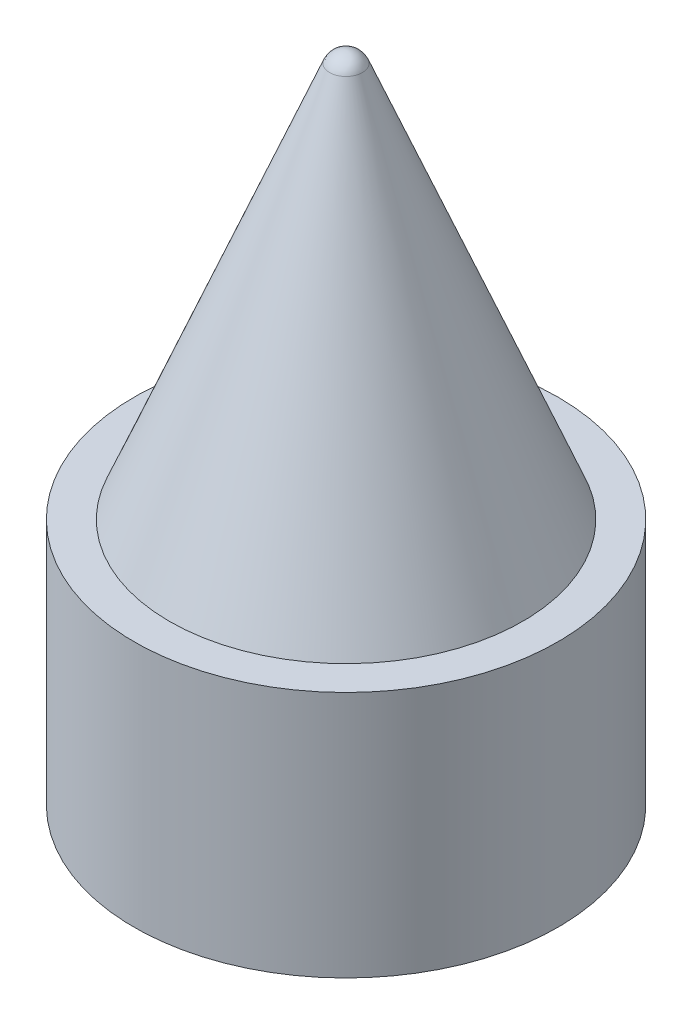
ISO-10303-21;
HEADER;
FILE_DESCRIPTION(('STEP AP214'),'2;1');
FILE_NAME('part.step','',(''),(''),'','','');
FILE_SCHEMA(('AUTOMOTIVE_DESIGN { 1 0 10303 214 1 1 1 1 }'));
ENDSEC;
DATA;
#1=APPLICATION_CONTEXT('core data for automotive mechanical design processes');
#2=APPLICATION_PROTOCOL_DEFINITION('international standard','automotive_design',2000,#1);
#3=PRODUCT_CONTEXT('',#1,'mechanical');
#4=PRODUCT('Part','Part','',(#3));
#5=PRODUCT_RELATED_PRODUCT_CATEGORY('part','',(#4));
#6=PRODUCT_DEFINITION_FORMATION('','',#4);
#7=PRODUCT_DEFINITION_CONTEXT('part definition',#1,'design');
#8=PRODUCT_DEFINITION('design','',#6,#7);
#9=PRODUCT_DEFINITION_SHAPE('','',#8);
#10=(LENGTH_UNIT() NAMED_UNIT(*) SI_UNIT(.MILLI.,.METRE.));
#11=(NAMED_UNIT(*) PLANE_ANGLE_UNIT() SI_UNIT($,.RADIAN.));
#12=(NAMED_UNIT(*) SI_UNIT($,.STERADIAN.) SOLID_ANGLE_UNIT());
#13=UNCERTAINTY_MEASURE_WITH_UNIT(LENGTH_MEASURE(1.E-05),#10,'distance_accuracy_value','');
#14=(GEOMETRIC_REPRESENTATION_CONTEXT(3) GLOBAL_UNCERTAINTY_ASSIGNED_CONTEXT((#13)) GLOBAL_UNIT_ASSIGNED_CONTEXT((#10,
#11,#12)) REPRESENTATION_CONTEXT('',''));
#15=CARTESIAN_POINT('',(0.,0.,0.));
#16=DIRECTION('',(0.,0.,1.));
#17=DIRECTION('',(1.,0.,0.));
#18=AXIS2_PLACEMENT_3D('',#15,#16,#17);
#19=CARTESIAN_POINT('',(0.,-5.,0.));
#20=DIRECTION('',(0.,-1.,0.));
#21=DIRECTION('',(0.,0.,-1.));
#22=AXIS2_PLACEMENT_3D('',#19,#20,#21);
#23=PLANE('',#22);
#24=CARTESIAN_POINT('',(0.,-5.,0.));
#25=DIRECTION('',(0.,-1.,0.));
#26=DIRECTION('',(0.,0.,-1.));
#27=AXIS2_PLACEMENT_3D('',#24,#25,#26);
#28=CIRCLE('',#27,6.);
#29=CARTESIAN_POINT('',(0.,-5.,-6.));
#30=VERTEX_POINT('',#29);
#31=EDGE_CURVE('E76',#30,#30,#28,.T.);
#32=ORIENTED_EDGE('',*,*,#31,.T.);
#33=EDGE_LOOP('',(#32));
#34=FACE_BOUND('',#33,.T.);
#35=CARTESIAN_POINT('',(0.,-5.,0.000228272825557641));
#36=DIRECTION('',(0.,-1.,0.));
#37=DIRECTION('',(0.,0.,-1.));
#38=AXIS2_PLACEMENT_3D('',#35,#36,#37);
#39=CIRCLE('',#38,4.99977174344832);
#40=CARTESIAN_POINT('',(0.,-5.,-4.99954347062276));
#41=VERTEX_POINT('',#40);
#42=EDGE_CURVE('E68',#41,#41,#39,.T.);
#43=ORIENTED_EDGE('',*,*,#42,.F.);
#44=EDGE_LOOP('',(#43));
#45=FACE_BOUND('',#44,.T.);
#46=ADVANCED_FACE('F41',(#34,#45),#23,.T.);
#47=CARTESIAN_POINT('',(0.,2.,0.));
#48=DIRECTION('',(0.,-1.,0.));
#49=DIRECTION('',(0.,0.,-1.));
#50=AXIS2_PLACEMENT_3D('',#47,#48,#49);
#51=CYLINDRICAL_SURFACE('',#50,6.);
#52=CARTESIAN_POINT('',(0.,2.,0.));
#53=DIRECTION('',(0.,-1.,0.));
#54=DIRECTION('',(0.,0.,-1.));
#55=AXIS2_PLACEMENT_3D('',#52,#53,#54);
#56=CIRCLE('',#55,6.);
#57=CARTESIAN_POINT('',(0.,2.,-6.));
#58=VERTEX_POINT('',#57);
#59=EDGE_CURVE('E50',#58,#58,#56,.T.);
#60=ORIENTED_EDGE('',*,*,#59,.T.);
#61=EDGE_LOOP('',(#60));
#62=FACE_BOUND('',#61,.T.);
#63=ORIENTED_EDGE('',*,*,#31,.F.);
#64=EDGE_LOOP('',(#63));
#65=FACE_BOUND('',#64,.T.);
#66=ADVANCED_FACE('F43',(#62,#65),#51,.T.);
#67=CARTESIAN_POINT('',(6.,2.,0.));
#68=DIRECTION('',(0.,1.,0.));
#69=DIRECTION('',(0.,0.,1.));
#70=AXIS2_PLACEMENT_3D('',#67,#68,#69);
#71=PLANE('',#70);
#72=CARTESIAN_POINT('',(0.,2.,-3.11540606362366E-06));
#73=DIRECTION('',(0.,1.,0.));
#74=DIRECTION('',(0.,0.,-1.));
#75=AXIS2_PLACEMENT_3D('',#72,#73,#74);
#76=ELLIPSE('',#75,5.00000311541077,5.00000307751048);
#77=CARTESIAN_POINT('',(0.,2.,-5.00000623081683));
#78=VERTEX_POINT('',#77);
#79=EDGE_CURVE('E11',#78,#78,#76,.T.);
#80=ORIENTED_EDGE('',*,*,#79,.F.);
#81=EDGE_LOOP('',(#80));
#82=FACE_BOUND('',#81,.T.);
#83=ORIENTED_EDGE('',*,*,#59,.F.);
#84=EDGE_LOOP('',(#83));
#85=FACE_BOUND('',#84,.T.);
#86=ADVANCED_FACE('F95',(#82,#85),#71,.T.);
#87=CARTESIAN_POINT('',(0.,2.00057049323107,0.000228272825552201));
#88=DIRECTION('',(0.,-0.999999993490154,-0.000114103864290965));
#89=DIRECTION('',(0.,0.000114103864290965,-0.999999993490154));
#90=AXIS2_PLACEMENT_3D('',#87,#88,#89);
#91=CONICAL_SURFACE('',#90,4.99977175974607,0.385204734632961);
#92=ORIENTED_EDGE('',*,*,#79,.T.);
#93=EDGE_LOOP('',(#92));
#94=FACE_BOUND('',#93,.T.);
#95=CARTESIAN_POINT('',(0.,13.1878744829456,0.00150478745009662));
#96=DIRECTION('',(0.,-0.999999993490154,-0.000114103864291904));
#97=DIRECTION('',(0.,-0.000114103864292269,0.999999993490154));
#98=AXIS2_PLACEMENT_3D('',#95,#96,#97);
#99=CIRCLE('',#98,0.463763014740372);
#100=CARTESIAN_POINT('',(0.,13.1878215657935,0.465267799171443));
#101=VERTEX_POINT('',#100);
#102=EDGE_CURVE('E67',#101,#101,#99,.T.);
#103=ORIENTED_EDGE('',*,*,#102,.T.);
#104=EDGE_LOOP('',(#103));
#105=FACE_BOUND('',#104,.T.);
#106=ADVANCED_FACE('F61',(#94,#105),#91,.T.);
#107=CARTESIAN_POINT('',(0.,13.,0.00188560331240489));
#108=DIRECTION('',(-1.,0.,0.));
#109=DIRECTION('',(0.,-0.000114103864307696,0.999999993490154));
#110=AXIS2_PLACEMENT_3D('',#107,#108,#109);
#111=CIRCLE('',#110,0.500000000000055);
#112=TRIMMED_CURVE('',#111,(PARAMETER_VALUE(-1.57160083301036)),
(PARAMETER_VALUE(1.57160083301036)),.T.,.PARAMETER.);
#113=CARTESIAN_POINT('',(0.,13.0000000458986,0.00148335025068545));
#114=DIRECTION('',(0.,0.999999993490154,0.000114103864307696));
#115=AXIS1_PLACEMENT('',#113,#114);
#116=SURFACE_OF_REVOLUTION('',#112,#115);
#117=ORIENTED_EDGE('',*,*,#102,.F.);
#118=EDGE_LOOP('',(#117));
#119=FACE_BOUND('',#118,.T.);
#120=CARTESIAN_POINT('',(0.,13.4999998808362,0.00154040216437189));
#121=VERTEX_POINT('',#120);
#122=VERTEX_LOOP('',#121);
#123=FACE_BOUND('',#122,.T.);
#124=ADVANCED_FACE('F88',(#119,#123),#116,.T.);
#125=CARTESIAN_POINT('',(0.,0.00114093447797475,0.000228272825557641));
#126=DIRECTION('',(0.,-1.,0.));
#127=DIRECTION('',(0.,0.,-1.));
#128=AXIS2_PLACEMENT_3D('',#125,#126,#127);
#129=CYLINDRICAL_SURFACE('',#128,4.99977174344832);
#130=ORIENTED_EDGE('',*,*,#42,.T.);
#131=EDGE_LOOP('',(#130));
#132=FACE_BOUND('',#131,.T.);
#133=CARTESIAN_POINT('',(0.,-1.16342302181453E-11,5.00000001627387));
#134=CARTESIAN_POINT('',(0.140620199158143,-8.66760134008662E-10,5.00000751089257));
#135=CARTESIAN_POINT('',(0.281172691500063,6.76673313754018E-07,4.99406931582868));
#136=CARTESIAN_POINT('',(0.561265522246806,3.37950136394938E-06,4.97038079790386));
#137=CARTESIAN_POINT('',(0.700806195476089,5.40432080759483E-06,4.9526345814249));
#138=CARTESIAN_POINT('',(0.977951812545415,1.07891118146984E-05,4.90544041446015));
#139=CARTESIAN_POINT('',(1.11555582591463,1.41497039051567E-05,4.87598702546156));
#140=CARTESIAN_POINT('',(1.38774430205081,2.21803501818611E-05,4.80560366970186));
#141=CARTESIAN_POINT('',(1.52232987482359,2.68499141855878E-05,4.76467799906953));
#142=CARTESIAN_POINT('',(1.78762084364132,3.74677536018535E-05,4.67161958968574));
#143=CARTESIAN_POINT('',(1.91832487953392,4.34164713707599E-05,4.6194829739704));
#144=CARTESIAN_POINT('',(2.17482802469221,5.65469122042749E-05,4.50440325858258));
#145=CARTESIAN_POINT('',(2.30062892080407,6.37281808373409E-05,4.44146414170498));
#146=CARTESIAN_POINT('',(2.54652098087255,7.92766463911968E-05,4.30519202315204));
#147=CARTESIAN_POINT('',(2.66661033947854,8.76442150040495E-05,4.2318557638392));
#148=CARTESIAN_POINT('',(2.90013986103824,0.00010550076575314,4.07535479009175));
#149=CARTESIAN_POINT('',(3.01358246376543,0.000114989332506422,3.99219371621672));
#150=CARTESIAN_POINT('',(3.23309140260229,0.000135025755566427,3.81658758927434));
#151=CARTESIAN_POINT('',(3.33915564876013,0.000145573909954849,3.72413992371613));
#152=CARTESIAN_POINT('',(3.54308083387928,0.000167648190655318,3.53067330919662));
#153=CARTESIAN_POINT('',(3.640944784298,0.000179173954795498,3.42965753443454));
#154=CARTESIAN_POINT('',(3.8278736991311,0.000203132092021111,3.21968015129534));
#155=CARTESIAN_POINT('',(3.91693336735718,0.000215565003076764,3.11071382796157));
#156=CARTESIAN_POINT('',(4.08552248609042,0.000241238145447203,2.8857055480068));
#157=CARTESIAN_POINT('',(4.16505543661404,0.000254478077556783,2.76966621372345));
#158=CARTESIAN_POINT('',(4.31412395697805,0.000281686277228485,2.53120416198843));
#159=CARTESIAN_POINT('',(4.38365143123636,0.000295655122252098,2.40877638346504));
#160=CARTESIAN_POINT('',(4.51211417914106,0.00032420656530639,2.15854168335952));
#161=CARTESIAN_POINT('',(4.5710533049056,0.000338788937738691,2.03073673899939));
#162=CARTESIAN_POINT('',(4.67790873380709,0.000368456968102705,1.77071588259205));
#163=CARTESIAN_POINT('',(4.72583383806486,0.000383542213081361,1.63850358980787));
#164=CARTESIAN_POINT('',(4.81036958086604,0.000414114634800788,1.37055633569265));
#165=CARTESIAN_POINT('',(4.8469829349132,0.000429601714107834,1.23482222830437));
#166=CARTESIAN_POINT('',(4.91829744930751,0.000465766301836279,0.917863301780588));
#167=CARTESIAN_POINT('',(4.94882209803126,0.000486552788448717,0.735683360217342));
#168=CARTESIAN_POINT('',(4.98955837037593,0.000528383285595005,0.369066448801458));
#169=CARTESIAN_POINT('',(4.99976999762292,0.000549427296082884,0.184629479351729));
#170=CARTESIAN_POINT('',(4.99977307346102,0.000586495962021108,-0.140253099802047));
#171=CARTESIAN_POINT('',(4.99384882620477,0.000602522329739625,-0.280713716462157));
#172=CARTESIAN_POINT('',(4.97019423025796,0.000634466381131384,-0.56068240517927));
#173=CARTESIAN_POINT('',(4.9524610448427,0.000650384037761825,-0.700190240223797));
#174=CARTESIAN_POINT('',(4.90529118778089,0.000682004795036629,-0.977325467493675));
#175=CARTESIAN_POINT('',(4.875845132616,0.000697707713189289,-1.11495126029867));
#176=CARTESIAN_POINT('',(4.80544674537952,0.000728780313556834,-1.38728225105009));
#177=CARTESIAN_POINT('',(4.76449022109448,0.000744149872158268,-1.52198636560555));
#178=CARTESIAN_POINT('',(4.67140441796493,0.000774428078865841,-1.78735501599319));
#179=CARTESIAN_POINT('',(4.6192841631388,0.000789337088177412,-1.91802271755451));
#180=CARTESIAN_POINT('',(4.50420067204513,0.000818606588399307,-2.17455071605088));
#181=CARTESIAN_POINT('',(4.44123344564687,0.000832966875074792,-2.3004092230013));
#182=CARTESIAN_POINT('',(4.30495782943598,0.000861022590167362,-2.54629918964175));
#183=CARTESIAN_POINT('',(4.23165561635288,0.000874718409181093,-2.66633407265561));
#184=CARTESIAN_POINT('',(4.07517366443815,0.000901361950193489,-2.89984725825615));
#185=CARTESIAN_POINT('',(3.99199029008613,0.00091430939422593,-3.01332312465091));
#186=CARTESIAN_POINT('',(3.81638318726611,0.00093935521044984,-3.23283329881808));
#187=CARTESIAN_POINT('',(3.72396199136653,0.000951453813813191,-3.33886963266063));
#188=CARTESIAN_POINT('',(3.53048128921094,0.000974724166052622,-3.54281902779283));
#189=CARTESIAN_POINT('',(3.42941860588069,0.000985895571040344,-3.64072907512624));
#190=CARTESIAN_POINT('',(3.21943813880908,0.00100722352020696,-3.82765457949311));
#191=CARTESIAN_POINT('',(3.11052298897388,0.0010173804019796,-3.91667299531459));
#192=CARTESIAN_POINT('',(2.88554045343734,0.00103661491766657,-4.08525092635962));
#193=CARTESIAN_POINT('',(2.76947044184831,0.00104569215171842,-4.16480693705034));
#194=CARTESIAN_POINT('',(2.53108518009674,0.00106269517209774,-4.31382727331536));
#195=CARTESIAN_POINT('',(2.40877235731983,0.00107062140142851,-4.38329548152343));
#196=CARTESIAN_POINT('',(2.15868682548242,0.00108527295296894,-4.51170673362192));
#197=CARTESIAN_POINT('',(2.03091211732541,0.00109199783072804,-4.57064588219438));
#198=CARTESIAN_POINT('',(1.77088873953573,0.00110419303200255,-4.67752883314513));
#199=CARTESIAN_POINT('',(1.63864174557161,0.00110966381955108,-4.72547670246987));
#200=CARTESIAN_POINT('',(1.37056887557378,0.00111931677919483,-4.81007857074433));
#201=CARTESIAN_POINT('',(1.23474169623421,0.00112349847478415,-4.84672839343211));
#202=CARTESIAN_POINT('',(0.823426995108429,0.00113405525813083,-4.9392516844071));
#203=CARTESIAN_POINT('',(0.543823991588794,0.00113845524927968,-4.97781472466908));
#204=CARTESIAN_POINT('',(-0.0177355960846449,0.00114183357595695,-5.0074235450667));
#205=CARTESIAN_POINT('',(-0.299692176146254,0.00114081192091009,-4.99846940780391));
#206=CARTESIAN_POINT('',(-0.858140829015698,0.00113338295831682,-4.93335941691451));
#207=CARTESIAN_POINT('',(-1.13463289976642,0.00112697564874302,-4.87720354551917));
#208=CARTESIAN_POINT('',(-1.67425426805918,0.00110895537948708,-4.71926768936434));
#209=CARTESIAN_POINT('',(-1.93738355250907,0.00109734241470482,-4.6174876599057));
#210=CARTESIAN_POINT('',(-2.44282280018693,0.00106924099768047,-4.37119714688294));
#211=CARTESIAN_POINT('',(-2.68513277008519,0.00105275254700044,-4.22668667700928));
#212=CARTESIAN_POINT('',(-3.14205137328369,0.00101536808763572,-3.89903637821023));
#213=CARTESIAN_POINT('',(-3.35666001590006,0.000994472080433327,-3.71589656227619));
#214=CARTESIAN_POINT('',(-3.75208494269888,0.000948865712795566,-3.31618662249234));
#215=CARTESIAN_POINT('',(-3.93290122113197,0.000924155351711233,-3.09961649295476));
#216=CARTESIAN_POINT('',(-4.25560827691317,0.000871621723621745,-2.6391936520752));
#217=CARTESIAN_POINT('',(-4.39749905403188,0.000843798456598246,-2.39534094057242));
#218=CARTESIAN_POINT('',(-4.63832730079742,0.000785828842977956,-1.88727524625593));
#219=CARTESIAN_POINT('',(-4.73726477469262,0.000755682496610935,-1.62306226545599));
#220=CARTESIAN_POINT('',(-4.889377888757,0.000693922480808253,-1.08177617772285));
#221=CARTESIAN_POINT('',(-4.94255351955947,0.000662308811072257,-0.804703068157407));
#222=CARTESIAN_POINT('',(-5.00163341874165,0.000598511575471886,-0.24556208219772));
#223=CARTESIAN_POINT('',(-5.00753768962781,0.000566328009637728,0.0365057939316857));
#224=CARTESIAN_POINT('',(-4.9719072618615,0.000502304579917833,0.597629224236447));
#225=CARTESIAN_POINT('',(-4.93037256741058,0.000470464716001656,0.876684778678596));
#226=CARTESIAN_POINT('',(-4.80104320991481,0.000408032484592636,1.42386239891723));
#227=CARTESIAN_POINT('',(-4.71324848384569,0.000377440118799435,1.69198444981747));
#228=CARTESIAN_POINT('',(-4.49389142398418,0.000318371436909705,2.20968276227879));
#229=CARTESIAN_POINT('',(-4.36232920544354,0.000289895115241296,2.45925907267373));
#230=CARTESIAN_POINT('',(-4.05917355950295,0.000235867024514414,2.9327799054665));
#231=CARTESIAN_POINT('',(-3.88758047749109,0.000210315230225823,3.15672464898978));
#232=CARTESIAN_POINT('',(-3.50922783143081,0.000162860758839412,3.57263201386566));
#233=CARTESIAN_POINT('',(-3.30246756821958,0.000140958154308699,3.76459399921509));
#234=CARTESIAN_POINT('',(-2.85964981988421,0.000101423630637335,4.11108820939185));
#235=CARTESIAN_POINT('',(-2.62359111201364,8.3791889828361E-05,4.26561887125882));
#236=CARTESIAN_POINT('',(-2.12888540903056,5.33023704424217E-05,4.53283954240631));
#237=CARTESIAN_POINT('',(-1.87024075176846,4.04440984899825E-05,4.64553387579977));
#238=CARTESIAN_POINT('',(-1.34625071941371,2.0191595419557E-05,4.82303380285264));
#239=CARTESIAN_POINT('',(-1.08138054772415,1.26364964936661E-05,4.8892492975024));
#240=CARTESIAN_POINT('',(-0.544255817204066,2.54151576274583E-06,4.977725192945));
#241=CARTESIAN_POINT('',(-0.272001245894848,1.64243334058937E-09,4.99998551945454));
#242=CARTESIAN_POINT('',(0.,-1.16342302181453E-11,5.00000001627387));
#243=B_SPLINE_CURVE_WITH_KNOTS('',3,(#133,#134,#135,#136,#137,#138,#139,#140,#141,#142,#143,
#144,#145,#146,#147,#148,#149,#150,#151,#152,#153,#154,#155,#156,#157,#158,#159,#160,#161,#162,
#163,#164,#165,#166,#167,#168,#169,#170,#171,#172,#173,#174,#175,#176,#177,#178,#179,#180,#181,
#182,#183,#184,#185,#186,#187,#188,#189,#190,#191,#192,#193,#194,#195,#196,#197,#198,#199,#200,
#201,#202,#203,#204,#205,#206,#207,#208,#209,#210,#211,#212,#213,#214,#215,#216,#217,#218,#219,
#220,#221,#222,#223,#224,#225,#226,#227,#228,#229,#230,#231,#232,#233,#234,#235,#236,#237,#238,
#239,#240,#241,#242),.UNSPECIFIED.,.T.,.F.,(4,2,2,2,2,2,2,2,2,2,2,2,2,2,2,2,2,2,2,2,2,2,2,2,2,2,
2,2,2,2,2,2,2,2,2,2,2,2,2,2,2,2,2,2,2,2,2,2,2,2,2,2,2,2,4),(0.,0.421618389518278,
0.843090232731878,1.26475809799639,1.6862682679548,2.10792443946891,2.52942548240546,
2.95105888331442,3.37253653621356,3.79413309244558,4.21557413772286,4.63726717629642,
5.05880481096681,5.48068162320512,5.90240464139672,6.32378948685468,6.74507309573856,
7.29806606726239,7.85105894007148,8.27234250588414,8.69372730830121,9.11545037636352,
9.53732723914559,9.95886436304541,10.3805568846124,10.8019984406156,11.2235955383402,
11.6450773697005,12.0667148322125,12.4882115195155,12.9098638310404,13.3313534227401,
13.7529986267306,14.1744875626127,14.5961321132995,15.438517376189,16.2809011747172,
17.1232852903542,17.9656702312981,18.8080549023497,19.6504392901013,20.4928238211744,
21.3352083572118,22.1775928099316,23.019977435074,23.8623620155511,24.7047465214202,
25.5471321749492,26.3895156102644,27.2318917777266,28.0742846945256,28.9167127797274,
29.7590537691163,30.5745876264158,31.3901228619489),.UNSPECIFIED.);
#244=CARTESIAN_POINT('',(0.,-1.16342302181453E-11,5.00000001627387));
#245=VERTEX_POINT('',#244);
#246=EDGE_CURVE('E64',#245,#245,#243,.T.);
#247=ORIENTED_EDGE('',*,*,#246,.T.);
#248=EDGE_LOOP('',(#247));
#249=FACE_BOUND('',#248,.T.);
#250=ADVANCED_FACE('F59',(#132,#249),#129,.F.);
#251=CARTESIAN_POINT('',(0.,0.000573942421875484,6.54890486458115E-08));
#252=DIRECTION('',(0.,0.999999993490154,0.000114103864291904));
#253=DIRECTION('',(0.,-0.000114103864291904,0.999999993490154));
#254=AXIS2_PLACEMENT_3D('',#251,#252,#253);
#255=CONICAL_SURFACE('',#254,5.02999996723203,1.57068222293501);
#256=CARTESIAN_POINT('',(0.,1.16342300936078E-11,1.13686837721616E-10));
#257=VERTEX_POINT('',#256);
#258=VERTEX_LOOP('',#257);
#259=FACE_BOUND('',#258,.T.);
#260=ORIENTED_EDGE('',*,*,#246,.F.);
#261=EDGE_LOOP('',(#260));
#262=FACE_BOUND('',#261,.T.);
#263=ADVANCED_FACE('F56',(#259,#262),#255,.T.);
#264=CLOSED_SHELL('',(#46,#66,#86,#106,#124,#250,#263));
#265=MANIFOLD_SOLID_BREP('B2',#264);
#266=ADVANCED_BREP_SHAPE_REPRESENTATION('',(#18,#265),#14);
#267=SHAPE_DEFINITION_REPRESENTATION(#9,#266);
ENDSEC;
END-ISO-10303-21;
